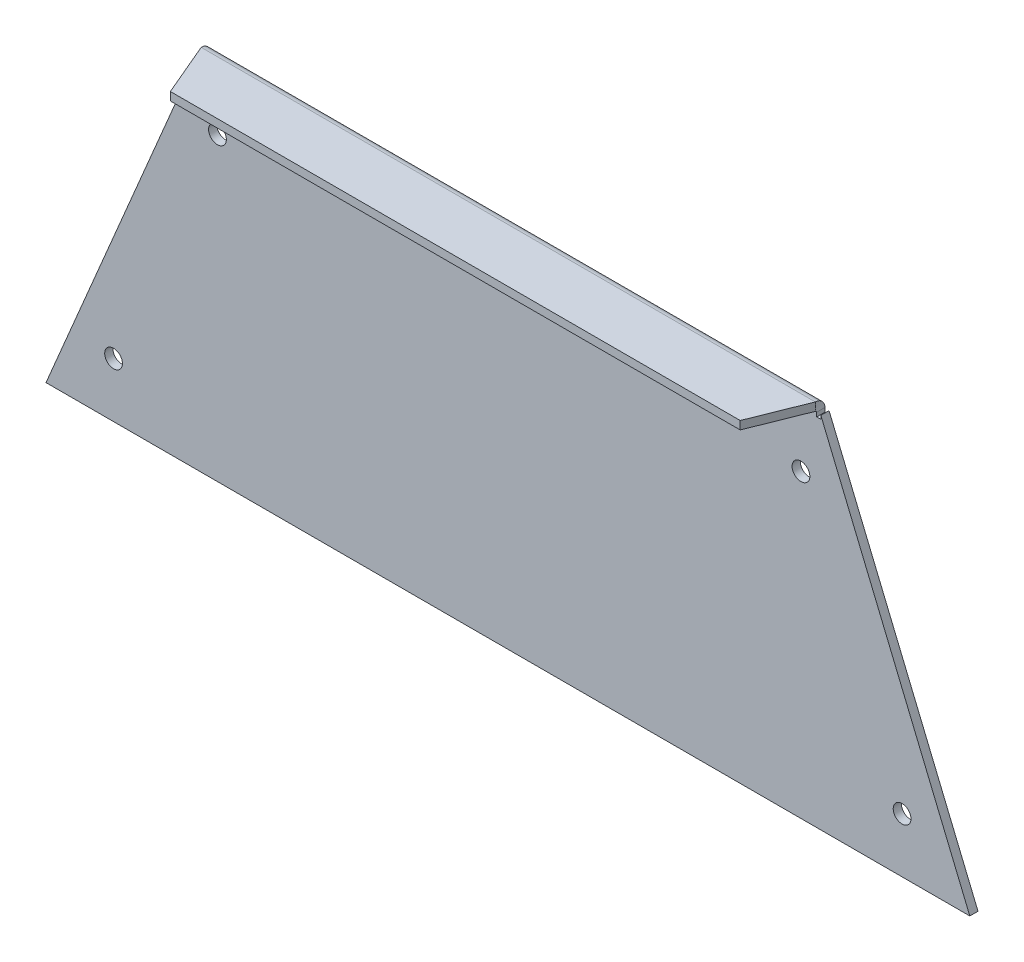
ISO-10303-21;
HEADER;
FILE_DESCRIPTION(('STEP AP214'),'2;1');
FILE_NAME('part.step','',(''),(''),'','','');
FILE_SCHEMA(('AUTOMOTIVE_DESIGN { 1 0 10303 214 1 1 1 1 }'));
ENDSEC;
DATA;
#1=APPLICATION_CONTEXT('core data for automotive mechanical design processes');
#2=APPLICATION_PROTOCOL_DEFINITION('international standard','automotive_design',2000,#1);
#3=PRODUCT_CONTEXT('',#1,'mechanical');
#4=PRODUCT('Part','Part','',(#3));
#5=PRODUCT_RELATED_PRODUCT_CATEGORY('part','',(#4));
#6=PRODUCT_DEFINITION_FORMATION('','',#4);
#7=PRODUCT_DEFINITION_CONTEXT('part definition',#1,'design');
#8=PRODUCT_DEFINITION('design','',#6,#7);
#9=PRODUCT_DEFINITION_SHAPE('','',#8);
#10=(LENGTH_UNIT() NAMED_UNIT(*) SI_UNIT(.MILLI.,.METRE.));
#11=(NAMED_UNIT(*) PLANE_ANGLE_UNIT() SI_UNIT($,.RADIAN.));
#12=(NAMED_UNIT(*) SI_UNIT($,.STERADIAN.) SOLID_ANGLE_UNIT());
#13=UNCERTAINTY_MEASURE_WITH_UNIT(LENGTH_MEASURE(1.E-05),#10,'distance_accuracy_value','');
#14=(GEOMETRIC_REPRESENTATION_CONTEXT(3) GLOBAL_UNCERTAINTY_ASSIGNED_CONTEXT((#13)) GLOBAL_UNIT_ASSIGNED_CONTEXT((#10,
#11,#12)) REPRESENTATION_CONTEXT('',''));
#15=CARTESIAN_POINT('',(0.,0.,0.));
#16=DIRECTION('',(0.,0.,1.));
#17=DIRECTION('',(1.,0.,0.));
#18=AXIS2_PLACEMENT_3D('',#15,#16,#17);
#19=CARTESIAN_POINT('',(-228.,-7.10526315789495,6.));
#20=DIRECTION('',(1.,0.,0.));
#21=DIRECTION('',(0.,1.,0.));
#22=AXIS2_PLACEMENT_3D('',#19,#20,#21);
#23=PLANE('',#22);
#24=DIRECTION('',(0.,-1.,0.));
#25=VECTOR('',#24,1.);
#26=CARTESIAN_POINT('',(-228.,0.,0.));
#27=LINE('',#26,#25);
#28=CARTESIAN_POINT('',(-228.,-7.10526315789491,0.));
#29=VERTEX_POINT('',#28);
#30=CARTESIAN_POINT('',(-228.,-9.73659999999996,0.));
#31=VERTEX_POINT('',#30);
#32=EDGE_CURVE('E15',#29,#31,#27,.T.);
#33=ORIENTED_EDGE('',*,*,#32,.F.);
#34=DIRECTION('',(0.,0.,-1.));
#35=VECTOR('',#34,1.);
#36=CARTESIAN_POINT('',(-228.,-7.10526315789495,6.));
#37=LINE('',#36,#35);
#38=CARTESIAN_POINT('',(-228.,-7.10526315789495,6.));
#39=VERTEX_POINT('',#38);
#40=EDGE_CURVE('E268',#39,#29,#37,.T.);
#41=ORIENTED_EDGE('',*,*,#40,.F.);
#42=DIRECTION('',(0.,-1.,0.));
#43=VECTOR('',#42,1.);
#44=CARTESIAN_POINT('',(-228.,-7.10526315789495,6.));
#45=LINE('',#44,#43);
#46=CARTESIAN_POINT('',(-228.,-9.7366,6.));
#47=VERTEX_POINT('',#46);
#48=EDGE_CURVE('E264',#39,#47,#45,.T.);
#49=ORIENTED_EDGE('',*,*,#48,.T.);
#50=DIRECTION('',(0.,0.,-1.));
#51=VECTOR('',#50,1.);
#52=CARTESIAN_POINT('',(-228.,-9.7366,6.));
#53=LINE('',#52,#51);
#54=EDGE_CURVE('E272',#47,#31,#53,.T.);
#55=ORIENTED_EDGE('',*,*,#54,.T.);
#56=EDGE_LOOP('',(#33,#41,#49,#55));
#57=FACE_BOUND('',#56,.T.);
#58=ADVANCED_FACE('F64',(#57),#23,.T.);
#59=CARTESIAN_POINT('',(-228.,-9.7366,6.));
#60=DIRECTION('',(0.,1.,0.));
#61=DIRECTION('',(0.,0.,1.));
#62=AXIS2_PLACEMENT_3D('',#59,#60,#61);
#63=PLANE('',#62);
#64=DIRECTION('',(1.,0.,0.));
#65=VECTOR('',#64,1.);
#66=CARTESIAN_POINT('',(-225.,-9.73659999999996,0.));
#67=LINE('',#66,#65);
#68=CARTESIAN_POINT('',(-225.,-9.73659999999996,0.));
#69=VERTEX_POINT('',#68);
#70=EDGE_CURVE('E73',#31,#69,#67,.T.);
#71=ORIENTED_EDGE('',*,*,#70,.F.);
#72=ORIENTED_EDGE('',*,*,#54,.F.);
#73=DIRECTION('',(1.,0.,0.));
#74=VECTOR('',#73,1.);
#75=CARTESIAN_POINT('',(-228.,-9.7366,6.));
#76=LINE('',#75,#74);
#77=CARTESIAN_POINT('',(-225.,-9.7366,6.));
#78=VERTEX_POINT('',#77);
#79=EDGE_CURVE('E269',#47,#78,#76,.T.);
#80=ORIENTED_EDGE('',*,*,#79,.T.);
#81=DIRECTION('',(0.,0.,-1.));
#82=VECTOR('',#81,1.);
#83=CARTESIAN_POINT('',(-225.,-9.7366,6.));
#84=LINE('',#83,#82);
#85=EDGE_CURVE('E276',#78,#69,#84,.T.);
#86=ORIENTED_EDGE('',*,*,#85,.T.);
#87=EDGE_LOOP('',(#71,#72,#80,#86));
#88=FACE_BOUND('',#87,.T.);
#89=ADVANCED_FACE('F390',(#88),#63,.T.);
#90=CARTESIAN_POINT('',(-225.,-9.7366,6.));
#91=DIRECTION('',(-1.,0.,0.));
#92=DIRECTION('',(0.,0.,1.));
#93=AXIS2_PLACEMENT_3D('',#90,#91,#92);
#94=PLANE('',#93);
#95=DIRECTION('',(0.,1.,0.));
#96=VECTOR('',#95,1.);
#97=CARTESIAN_POINT('',(-225.,0.,0.));
#98=LINE('',#97,#96);
#99=CARTESIAN_POINT('',(-225.,-6.7366,0.));
#100=VERTEX_POINT('',#99);
#101=EDGE_CURVE('E322',#69,#100,#98,.T.);
#102=ORIENTED_EDGE('',*,*,#101,.F.);
#103=ORIENTED_EDGE('',*,*,#85,.F.);
#104=DIRECTION('',(0.,1.,0.));
#105=VECTOR('',#104,1.);
#106=CARTESIAN_POINT('',(-225.,-9.7366,6.));
#107=LINE('',#106,#105);
#108=CARTESIAN_POINT('',(-225.,-6.7366,6.));
#109=VERTEX_POINT('',#108);
#110=EDGE_CURVE('E273',#78,#109,#107,.T.);
#111=ORIENTED_EDGE('',*,*,#110,.T.);
#112=DIRECTION('',(0.,0.,-1.));
#113=VECTOR('',#112,1.);
#114=CARTESIAN_POINT('',(-225.,-6.7366,6.));
#115=LINE('',#114,#113);
#116=EDGE_CURVE('E261',#109,#100,#115,.T.);
#117=ORIENTED_EDGE('',*,*,#116,.T.);
#118=EDGE_LOOP('',(#102,#103,#111,#117));
#119=FACE_BOUND('',#118,.T.);
#120=ADVANCED_FACE('F386',(#119),#94,.T.);
#121=CARTESIAN_POINT('',(225.,-6.7366,6.));
#122=DIRECTION('',(1.,0.,0.));
#123=DIRECTION('',(0.,0.,-1.));
#124=AXIS2_PLACEMENT_3D('',#121,#122,#123);
#125=PLANE('',#124);
#126=DIRECTION('',(0.,-1.,0.));
#127=VECTOR('',#126,1.);
#128=CARTESIAN_POINT('',(225.,0.,0.));
#129=LINE('',#128,#127);
#130=CARTESIAN_POINT('',(225.,-6.73659999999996,0.));
#131=VERTEX_POINT('',#130);
#132=CARTESIAN_POINT('',(225.,-9.73659999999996,0.));
#133=VERTEX_POINT('',#132);
#134=EDGE_CURVE('E319',#131,#133,#129,.T.);
#135=ORIENTED_EDGE('',*,*,#134,.F.);
#136=DIRECTION('',(0.,0.,-1.));
#137=VECTOR('',#136,1.);
#138=CARTESIAN_POINT('',(225.,-6.7366,6.));
#139=LINE('',#138,#137);
#140=CARTESIAN_POINT('',(225.,-6.7366,6.));
#141=VERTEX_POINT('',#140);
#142=EDGE_CURVE('E252',#141,#131,#139,.T.);
#143=ORIENTED_EDGE('',*,*,#142,.F.);
#144=DIRECTION('',(0.,-1.,0.));
#145=VECTOR('',#144,1.);
#146=CARTESIAN_POINT('',(225.,-6.7366,6.));
#147=LINE('',#146,#145);
#148=CARTESIAN_POINT('',(225.,-9.7366,6.));
#149=VERTEX_POINT('',#148);
#150=EDGE_CURVE('E277',#141,#149,#147,.T.);
#151=ORIENTED_EDGE('',*,*,#150,.T.);
#152=DIRECTION('',(0.,0.,-1.));
#153=VECTOR('',#152,1.);
#154=CARTESIAN_POINT('',(225.,-9.7366,6.));
#155=LINE('',#154,#153);
#156=EDGE_CURVE('E283',#149,#133,#155,.T.);
#157=ORIENTED_EDGE('',*,*,#156,.T.);
#158=EDGE_LOOP('',(#135,#143,#151,#157));
#159=FACE_BOUND('',#158,.T.);
#160=ADVANCED_FACE('F377',(#159),#125,.T.);
#161=CARTESIAN_POINT('',(225.,-9.7366,6.));
#162=DIRECTION('',(0.,1.,0.));
#163=DIRECTION('',(0.,0.,1.));
#164=AXIS2_PLACEMENT_3D('',#161,#162,#163);
#165=PLANE('',#164);
#166=DIRECTION('',(1.,0.,0.));
#167=VECTOR('',#166,1.);
#168=CARTESIAN_POINT('',(-225.,-9.73659999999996,0.));
#169=LINE('',#168,#167);
#170=CARTESIAN_POINT('',(228.,-9.73659999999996,0.));
#171=VERTEX_POINT('',#170);
#172=EDGE_CURVE('E316',#133,#171,#169,.T.);
#173=ORIENTED_EDGE('',*,*,#172,.F.);
#174=ORIENTED_EDGE('',*,*,#156,.F.);
#175=DIRECTION('',(1.,0.,0.));
#176=VECTOR('',#175,1.);
#177=CARTESIAN_POINT('',(225.,-9.7366,6.));
#178=LINE('',#177,#176);
#179=CARTESIAN_POINT('',(228.,-9.7366,6.));
#180=VERTEX_POINT('',#179);
#181=EDGE_CURVE('E280',#149,#180,#178,.T.);
#182=ORIENTED_EDGE('',*,*,#181,.T.);
#183=DIRECTION('',(0.,0.,-1.));
#184=VECTOR('',#183,1.);
#185=CARTESIAN_POINT('',(228.,-9.7366,6.));
#186=LINE('',#185,#184);
#187=EDGE_CURVE('E260',#180,#171,#186,.T.);
#188=ORIENTED_EDGE('',*,*,#187,.T.);
#189=EDGE_LOOP('',(#173,#174,#182,#188));
#190=FACE_BOUND('',#189,.T.);
#191=ADVANCED_FACE('F369',(#190),#165,.T.);
#192=CARTESIAN_POINT('',(228.,-9.7366,6.));
#193=DIRECTION('',(-1.,0.,0.));
#194=DIRECTION('',(0.,0.,1.));
#195=AXIS2_PLACEMENT_3D('',#192,#193,#194);
#196=PLANE('',#195);
#197=DIRECTION('',(0.,1.,0.));
#198=VECTOR('',#197,1.);
#199=CARTESIAN_POINT('',(228.,0.,0.));
#200=LINE('',#199,#198);
#201=CARTESIAN_POINT('',(228.,-7.23214285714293,0.));
#202=VERTEX_POINT('',#201);
#203=EDGE_CURVE('E314',#171,#202,#200,.T.);
#204=ORIENTED_EDGE('',*,*,#203,.F.);
#205=ORIENTED_EDGE('',*,*,#187,.F.);
#206=DIRECTION('',(0.,1.,0.));
#207=VECTOR('',#206,1.);
#208=CARTESIAN_POINT('',(228.,-9.7366,6.));
#209=LINE('',#208,#207);
#210=CARTESIAN_POINT('',(228.,-7.23214285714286,6.));
#211=VERTEX_POINT('',#210);
#212=EDGE_CURVE('E284',#180,#211,#209,.T.);
#213=ORIENTED_EDGE('',*,*,#212,.T.);
#214=DIRECTION('',(0.,0.,-1.));
#215=VECTOR('',#214,1.);
#216=CARTESIAN_POINT('',(228.,-7.23214285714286,6.));
#217=LINE('',#216,#215);
#218=EDGE_CURVE('E81',#211,#202,#217,.T.);
#219=ORIENTED_EDGE('',*,*,#218,.T.);
#220=EDGE_LOOP('',(#204,#205,#213,#219));
#221=FACE_BOUND('',#220,.T.);
#222=ADVANCED_FACE('F367',(#221),#196,.T.);
#223=CARTESIAN_POINT('',(-339.,-270.,6.));
#224=DIRECTION('',(0.921249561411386,-0.388972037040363,0.));
#225=DIRECTION('',(0.388972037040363,0.921249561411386,0.));
#226=AXIS2_PLACEMENT_3D('',#223,#224,#225);
#227=PLANE('',#226);
#228=ORIENTED_EDGE('',*,*,#40,.T.);
#229=DIRECTION('',(-0.388972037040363,-0.921249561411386,0.));
#230=VECTOR('',#229,1.);
#231=CARTESIAN_POINT('',(-339.,-270.,0.));
#232=LINE('',#231,#230);
#233=CARTESIAN_POINT('',(-339.,-270.,0.));
#234=VERTEX_POINT('',#233);
#235=EDGE_CURVE('E267',#29,#234,#232,.T.);
#236=ORIENTED_EDGE('',*,*,#235,.T.);
#237=DIRECTION('',(0.,0.,-1.));
#238=VECTOR('',#237,1.);
#239=CARTESIAN_POINT('',(-339.,-270.,6.));
#240=LINE('',#239,#238);
#241=CARTESIAN_POINT('',(-339.,-270.,6.));
#242=VERTEX_POINT('',#241);
#243=EDGE_CURVE('E311',#242,#234,#240,.T.);
#244=ORIENTED_EDGE('',*,*,#243,.F.);
#245=DIRECTION('',(-0.388972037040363,-0.921249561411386,0.));
#246=VECTOR('',#245,1.);
#247=CARTESIAN_POINT('',(-339.,-270.,6.));
#248=LINE('',#247,#246);
#249=EDGE_CURVE('E303',#39,#242,#248,.T.);
#250=ORIENTED_EDGE('',*,*,#249,.F.);
#251=EDGE_LOOP('',(#228,#236,#244,#250));
#252=FACE_BOUND('',#251,.T.);
#253=ADVANCED_FACE('F66',(#252),#227,.F.);
#254=CARTESIAN_POINT('',(225.,0.,6.));
#255=DIRECTION('',(-0.923683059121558,-0.383157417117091,0.));
#256=DIRECTION('',(0.383157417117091,-0.923683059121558,0.));
#257=AXIS2_PLACEMENT_3D('',#254,#255,#256);
#258=PLANE('',#257);
#259=ORIENTED_EDGE('',*,*,#218,.F.);
#260=DIRECTION('',(-0.383157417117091,0.923683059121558,0.));
#261=VECTOR('',#260,1.);
#262=CARTESIAN_POINT('',(225.,0.,6.));
#263=LINE('',#262,#261);
#264=CARTESIAN_POINT('',(337.,-270.,6.));
#265=VERTEX_POINT('',#264);
#266=EDGE_CURVE('E306',#265,#211,#263,.T.);
#267=ORIENTED_EDGE('',*,*,#266,.F.);
#268=DIRECTION('',(0.,0.,-1.));
#269=VECTOR('',#268,1.);
#270=CARTESIAN_POINT('',(337.,-270.,6.));
#271=LINE('',#270,#269);
#272=CARTESIAN_POINT('',(337.,-270.,0.));
#273=VERTEX_POINT('',#272);
#274=EDGE_CURVE('E308',#265,#273,#271,.T.);
#275=ORIENTED_EDGE('',*,*,#274,.T.);
#276=DIRECTION('',(-0.383157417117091,0.923683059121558,0.));
#277=VECTOR('',#276,1.);
#278=CARTESIAN_POINT('',(225.,0.,0.));
#279=LINE('',#278,#277);
#280=EDGE_CURVE('E300',#273,#202,#279,.T.);
#281=ORIENTED_EDGE('',*,*,#280,.T.);
#282=EDGE_LOOP('',(#259,#267,#275,#281));
#283=FACE_BOUND('',#282,.T.);
#284=ADVANCED_FACE('F375',(#283),#258,.F.);
#285=CARTESIAN_POINT('',(-225.,0.,6.));
#286=DIRECTION('',(0.,0.,-1.));
#287=DIRECTION('',(-1.,0.,0.));
#288=AXIS2_PLACEMENT_3D('',#285,#286,#287);
#289=PLANE('',#288);
#290=CARTESIAN_POINT('',(287.453354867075,-230.,6.));
#291=DIRECTION('',(0.,0.,1.));
#292=DIRECTION('',(1.,0.,0.));
#293=AXIS2_PLACEMENT_3D('',#290,#291,#292);
#294=CIRCLE('',#293,6.50000000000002);
#295=CARTESIAN_POINT('',(293.953354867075,-230.,6.));
#296=VERTEX_POINT('',#295);
#297=EDGE_CURVE('E345',#296,#296,#294,.T.);
#298=ORIENTED_EDGE('',*,*,#297,.F.);
#299=EDGE_LOOP('',(#298));
#300=FACE_BOUND('',#299,.T.);
#301=CARTESIAN_POINT('',(213.453354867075,-50.0000000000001,6.));
#302=DIRECTION('',(0.,0.,1.));
#303=DIRECTION('',(1.,0.,0.));
#304=AXIS2_PLACEMENT_3D('',#301,#302,#303);
#305=CIRCLE('',#304,6.50000000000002);
#306=CARTESIAN_POINT('',(219.953354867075,-50.0000000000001,6.));
#307=VERTEX_POINT('',#306);
#308=EDGE_CURVE('E335',#307,#307,#305,.T.);
#309=ORIENTED_EDGE('',*,*,#308,.F.);
#310=EDGE_LOOP('',(#309));
#311=FACE_BOUND('',#310,.T.);
#312=CARTESIAN_POINT('',(-289.546645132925,-230.,6.));
#313=DIRECTION('',(0.,0.,1.));
#314=DIRECTION('',(1.,0.,0.));
#315=AXIS2_PLACEMENT_3D('',#312,#313,#314);
#316=CIRCLE('',#315,6.50000000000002);
#317=CARTESIAN_POINT('',(-283.046645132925,-230.,6.));
#318=VERTEX_POINT('',#317);
#319=EDGE_CURVE('E332',#318,#318,#316,.T.);
#320=ORIENTED_EDGE('',*,*,#319,.F.);
#321=EDGE_LOOP('',(#320));
#322=FACE_BOUND('',#321,.T.);
#323=CARTESIAN_POINT('',(-213.546645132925,-50.0000000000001,6.));
#324=DIRECTION('',(0.,0.,1.));
#325=DIRECTION('',(1.,0.,0.));
#326=AXIS2_PLACEMENT_3D('',#323,#324,#325);
#327=CIRCLE('',#326,6.50000000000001);
#328=CARTESIAN_POINT('',(-207.046645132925,-50.0000000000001,6.));
#329=VERTEX_POINT('',#328);
#330=EDGE_CURVE('E329',#329,#329,#327,.T.);
#331=ORIENTED_EDGE('',*,*,#330,.F.);
#332=EDGE_LOOP('',(#331));
#333=FACE_BOUND('',#332,.T.);
#334=ORIENTED_EDGE('',*,*,#48,.F.);
#335=ORIENTED_EDGE('',*,*,#249,.T.);
#336=DIRECTION('',(1.,0.,0.));
#337=VECTOR('',#336,1.);
#338=CARTESIAN_POINT('',(337.,-270.,6.));
#339=LINE('',#338,#337);
#340=EDGE_CURVE('E89',#242,#265,#339,.T.);
#341=ORIENTED_EDGE('',*,*,#340,.T.);
#342=ORIENTED_EDGE('',*,*,#266,.T.);
#343=ORIENTED_EDGE('',*,*,#212,.F.);
#344=ORIENTED_EDGE('',*,*,#181,.F.);
#345=ORIENTED_EDGE('',*,*,#150,.F.);
#346=DIRECTION('',(-1.,0.,0.));
#347=VECTOR('',#346,1.);
#348=CARTESIAN_POINT('',(-225.,-6.7366,6.));
#349=LINE('',#348,#347);
#350=EDGE_CURVE('E210',#109,#141,#349,.F.);
#351=ORIENTED_EDGE('',*,*,#350,.F.);
#352=ORIENTED_EDGE('',*,*,#110,.F.);
#353=ORIENTED_EDGE('',*,*,#79,.F.);
#354=EDGE_LOOP('',(#334,#335,#341,#342,#343,#344,#345,#351,#352,#353));
#355=FACE_BOUND('',#354,.T.);
#356=ADVANCED_FACE('F402',(#300,#311,#322,#333,#355),#289,.F.);
#357=CARTESIAN_POINT('',(-225.,0.,0.));
#358=DIRECTION('',(0.,0.,-1.));
#359=DIRECTION('',(-1.,0.,0.));
#360=AXIS2_PLACEMENT_3D('',#357,#358,#359);
#361=PLANE('',#360);
#362=CARTESIAN_POINT('',(287.453354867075,-230.,0.));
#363=DIRECTION('',(0.,0.,-1.));
#364=DIRECTION('',(-1.,0.,0.));
#365=AXIS2_PLACEMENT_3D('',#362,#363,#364);
#366=CIRCLE('',#365,6.50000000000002);
#367=CARTESIAN_POINT('',(280.953354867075,-230.,0.));
#368=VERTEX_POINT('',#367);
#369=EDGE_CURVE('E68',#368,#368,#366,.T.);
#370=ORIENTED_EDGE('',*,*,#369,.F.);
#371=EDGE_LOOP('',(#370));
#372=FACE_BOUND('',#371,.T.);
#373=CARTESIAN_POINT('',(213.453354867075,-50.0000000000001,0.));
#374=DIRECTION('',(0.,0.,-1.));
#375=DIRECTION('',(-1.,0.,0.));
#376=AXIS2_PLACEMENT_3D('',#373,#374,#375);
#377=CIRCLE('',#376,6.50000000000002);
#378=CARTESIAN_POINT('',(206.953354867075,-50.0000000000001,0.));
#379=VERTEX_POINT('',#378);
#380=EDGE_CURVE('E333',#379,#379,#377,.T.);
#381=ORIENTED_EDGE('',*,*,#380,.F.);
#382=EDGE_LOOP('',(#381));
#383=FACE_BOUND('',#382,.T.);
#384=CARTESIAN_POINT('',(-289.546645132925,-230.,0.));
#385=DIRECTION('',(0.,0.,-1.));
#386=DIRECTION('',(-1.,0.,0.));
#387=AXIS2_PLACEMENT_3D('',#384,#385,#386);
#388=CIRCLE('',#387,6.50000000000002);
#389=CARTESIAN_POINT('',(-296.046645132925,-230.,0.));
#390=VERTEX_POINT('',#389);
#391=EDGE_CURVE('E330',#390,#390,#388,.T.);
#392=ORIENTED_EDGE('',*,*,#391,.F.);
#393=EDGE_LOOP('',(#392));
#394=FACE_BOUND('',#393,.T.);
#395=CARTESIAN_POINT('',(-213.546645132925,-50.0000000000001,0.));
#396=DIRECTION('',(0.,0.,-1.));
#397=DIRECTION('',(-1.,0.,0.));
#398=AXIS2_PLACEMENT_3D('',#395,#396,#397);
#399=CIRCLE('',#398,6.50000000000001);
#400=CARTESIAN_POINT('',(-220.046645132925,-50.0000000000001,0.));
#401=VERTEX_POINT('',#400);
#402=EDGE_CURVE('E209',#401,#401,#399,.T.);
#403=ORIENTED_EDGE('',*,*,#402,.F.);
#404=EDGE_LOOP('',(#403));
#405=FACE_BOUND('',#404,.T.);
#406=ORIENTED_EDGE('',*,*,#235,.F.);
#407=ORIENTED_EDGE('',*,*,#32,.T.);
#408=ORIENTED_EDGE('',*,*,#70,.T.);
#409=ORIENTED_EDGE('',*,*,#101,.T.);
#410=DIRECTION('',(-1.,0.,0.));
#411=VECTOR('',#410,1.);
#412=CARTESIAN_POINT('',(-225.,-6.7366,0.));
#413=LINE('',#412,#411);
#414=EDGE_CURVE('E219',#100,#131,#413,.F.);
#415=ORIENTED_EDGE('',*,*,#414,.T.);
#416=ORIENTED_EDGE('',*,*,#134,.T.);
#417=ORIENTED_EDGE('',*,*,#172,.T.);
#418=ORIENTED_EDGE('',*,*,#203,.T.);
#419=ORIENTED_EDGE('',*,*,#280,.F.);
#420=DIRECTION('',(1.,0.,0.));
#421=VECTOR('',#420,1.);
#422=CARTESIAN_POINT('',(337.,-270.,0.));
#423=LINE('',#422,#421);
#424=EDGE_CURVE('E298',#234,#273,#423,.T.);
#425=ORIENTED_EDGE('',*,*,#424,.F.);
#426=EDGE_LOOP('',(#406,#407,#408,#409,#415,#416,#417,#418,#419,#425));
#427=FACE_BOUND('',#426,.T.);
#428=ADVANCED_FACE('F398',(#372,#383,#394,#405,#427),#361,.T.);
#429=CARTESIAN_POINT('',(337.,-270.,6.));
#430=DIRECTION('',(0.,1.,0.));
#431=DIRECTION('',(-1.,0.,0.));
#432=AXIS2_PLACEMENT_3D('',#429,#430,#431);
#433=PLANE('',#432);
#434=ORIENTED_EDGE('',*,*,#424,.T.);
#435=ORIENTED_EDGE('',*,*,#274,.F.);
#436=ORIENTED_EDGE('',*,*,#340,.F.);
#437=ORIENTED_EDGE('',*,*,#243,.T.);
#438=EDGE_LOOP('',(#434,#435,#436,#437));
#439=FACE_BOUND('',#438,.T.);
#440=ADVANCED_FACE('F401',(#439),#433,.F.);
#441=CARTESIAN_POINT('',(225.,-6.7366,-0.0599999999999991));
#442=CARTESIAN_POINT('',(224.975442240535,-5.8467668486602,-0.0599999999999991));
#443=CARTESIAN_POINT('',(224.950893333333,-4.95760432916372,0.116897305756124));
#444=CARTESIAN_POINT('',(224.901786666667,-3.31370323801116,0.797823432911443));
#445=CARTESIAN_POINT('',(224.877233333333,-2.55977176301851,1.30158433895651));
#446=CARTESIAN_POINT('',(224.828126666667,-1.30158433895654,2.55977176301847));
#447=CARTESIAN_POINT('',(224.803573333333,-0.797823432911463,3.31370323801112));
#448=CARTESIAN_POINT('',(224.754466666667,-0.116897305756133,4.95760432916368));
#449=CARTESIAN_POINT('',(224.729917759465,0.0599999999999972,5.84676684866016));
#450=CARTESIAN_POINT('',(224.70536,0.0600000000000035,6.73659999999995));
#451=CARTESIAN_POINT('',(225.,-6.7366,0.));
#452=CARTESIAN_POINT('',(224.975442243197,-5.85462225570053,0.));
#453=CARTESIAN_POINT('',(224.950893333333,-4.97330920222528,0.175335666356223));
#454=CARTESIAN_POINT('',(224.901786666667,-3.34392037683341,0.850250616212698));
#455=CARTESIAN_POINT('',(224.877233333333,-2.596644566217,1.3495643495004));
#456=CARTESIAN_POINT('',(224.828126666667,-1.34956434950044,2.59664456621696));
#457=CARTESIAN_POINT('',(224.803573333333,-0.850250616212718,3.34392037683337));
#458=CARTESIAN_POINT('',(224.754466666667,-0.175335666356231,4.97330920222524));
#459=CARTESIAN_POINT('',(224.729917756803,0.,5.85462225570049));
#460=CARTESIAN_POINT('',(224.70536,0.,6.73659999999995));
#461=CARTESIAN_POINT('',(225.,-6.7366,6.));
#462=CARTESIAN_POINT('',(224.975442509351,-6.64016295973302,6.));
#463=CARTESIAN_POINT('',(224.950893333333,-6.54379650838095,6.01917172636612));
#464=CARTESIAN_POINT('',(224.901786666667,-6.36563425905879,6.09296894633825));
#465=CARTESIAN_POINT('',(224.877233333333,-6.28392488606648,6.1475654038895));
#466=CARTESIAN_POINT('',(224.828126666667,-6.1475654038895,6.28392488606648));
#467=CARTESIAN_POINT('',(224.803573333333,-6.09296894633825,6.36563425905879));
#468=CARTESIAN_POINT('',(224.754466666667,-6.01917172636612,6.54379650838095));
#469=CARTESIAN_POINT('',(224.729917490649,-6.,6.64016295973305));
#470=CARTESIAN_POINT('',(224.70536,-6.,6.7366));
#471=CARTESIAN_POINT('',(225.,-6.7366,6.0606));
#472=CARTESIAN_POINT('',(224.975442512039,-6.64809692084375,6.0606));
#473=CARTESIAN_POINT('',(224.950893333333,-6.55965843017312,6.07819447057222));
#474=CARTESIAN_POINT('',(224.901786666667,-6.39615356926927,6.14592040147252));
#475=CARTESIAN_POINT('',(224.877233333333,-6.32116641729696,6.19602521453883));
#476=CARTESIAN_POINT('',(224.828126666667,-6.19602521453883,6.32116641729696));
#477=CARTESIAN_POINT('',(224.803573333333,-6.14592040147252,6.39615356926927));
#478=CARTESIAN_POINT('',(224.754466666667,-6.07819447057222,6.55965843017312));
#479=CARTESIAN_POINT('',(224.729917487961,-6.0606,6.64809692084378));
#480=CARTESIAN_POINT('',(224.70536,-6.0606,6.7366));
#481=B_SPLINE_SURFACE_WITH_KNOTS('',1,3,((#441,#442,#443,#444,#445,#446,#447,#448,#449,#450),
(#451,#452,#453,#454,#455,#456,#457,#458,#459,#460),(#461,#462,#463,#464,#465,#466,#467,#468,
#469,#470),(#471,#472,#473,#474,#475,#476,#477,#478,#479,#480)),.UNSPECIFIED.,.F.,.F.,.F.,(2,1,
1,2),(4,2,2,2,4),(-0.01,0.,1.,1.0101),(0.,0.25,0.5,0.75,1.),.UNSPECIFIED.);
#482=DIRECTION('',(0.,-1.,0.));
#483=VECTOR('',#482,1.);
#484=CARTESIAN_POINT('',(224.70536,0.,6.73659999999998));
#485=LINE('',#484,#483);
#486=CARTESIAN_POINT('',(224.70536,-6.,6.7366));
#487=VERTEX_POINT('',#486);
#488=CARTESIAN_POINT('',(224.70536,0.,6.73659999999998));
#489=VERTEX_POINT('',#488);
#490=EDGE_CURVE('E192',#487,#489,#485,.F.);
#491=CARTESIAN_POINT('',(225.,-6.7366,6.));
#492=CARTESIAN_POINT('',(224.996930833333,-6.72454739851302,5.99999974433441));
#493=CARTESIAN_POINT('',(224.993861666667,-6.71249481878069,6.00029580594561));
#494=CARTESIAN_POINT('',(224.987723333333,-6.68841868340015,6.00147872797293));
#495=CARTESIAN_POINT('',(224.984654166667,-6.67639512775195,6.00236558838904));
#496=CARTESIAN_POINT('',(224.978515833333,-6.65240602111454,6.00472827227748));
#497=CARTESIAN_POINT('',(224.975446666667,-6.64044047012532,6.00620409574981));
#498=CARTESIAN_POINT('',(224.969308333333,-6.61659619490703,6.00974106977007));
#499=CARTESIAN_POINT('',(224.966239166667,-6.60471747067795,6.011802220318));
#500=CARTESIAN_POINT('',(224.960100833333,-6.5810754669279,6.01650490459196));
#501=CARTESIAN_POINT('',(224.957031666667,-6.56931218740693,6.01914643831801));
#502=CARTESIAN_POINT('',(224.950893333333,-6.54592941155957,6.0250035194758));
#503=CARTESIAN_POINT('',(224.947824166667,-6.53430991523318,6.02821906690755));
#504=CARTESIAN_POINT('',(224.941685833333,-6.51124269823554,6.03521643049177));
#505=CARTESIAN_POINT('',(224.938616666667,-6.49979497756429,6.03899824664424));
#506=CARTESIAN_POINT('',(224.932478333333,-6.4770988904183,6.04711903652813));
#507=CARTESIAN_POINT('',(224.929409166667,-6.46585052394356,6.05145801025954));
#508=CARTESIAN_POINT('',(224.923270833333,-6.44358024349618,6.06068266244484));
#509=CARTESIAN_POINT('',(224.920201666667,-6.43255832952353,6.06556834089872));
#510=CARTESIAN_POINT('',(224.914063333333,-6.41076750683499,6.07587463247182));
#511=CARTESIAN_POINT('',(224.910994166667,-6.3999985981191,6.08129524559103));
#512=CARTESIAN_POINT('',(224.904855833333,-6.37873972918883,6.09265834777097));
#513=CARTESIAN_POINT('',(224.901786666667,-6.36824976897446,6.09860083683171));
#514=CARTESIAN_POINT('',(224.895648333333,-6.34757406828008,6.1109933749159));
#515=CARTESIAN_POINT('',(224.892579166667,-6.33738832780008,6.11744342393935));
#516=CARTESIAN_POINT('',(224.886440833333,-6.31734560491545,6.13083554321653));
#517=CARTESIAN_POINT('',(224.883371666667,-6.30748862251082,6.13777761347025));
#518=CARTESIAN_POINT('',(224.877233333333,-6.28812716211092,6.15213705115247));
#519=CARTESIAN_POINT('',(224.874164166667,-6.27862268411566,6.15955441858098));
#520=CARTESIAN_POINT('',(224.868025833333,-6.25998912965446,6.17484658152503));
#521=CARTESIAN_POINT('',(224.864956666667,-6.25086005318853,6.18272137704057));
#522=CARTESIAN_POINT('',(224.858818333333,-6.23299929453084,6.19890942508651));
#523=CARTESIAN_POINT('',(224.855749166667,-6.22426761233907,6.2072226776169));
#524=CARTESIAN_POINT('',(224.849610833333,-6.2072226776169,6.22426761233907));
#525=CARTESIAN_POINT('',(224.846541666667,-6.1989094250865,6.23299929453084));
#526=CARTESIAN_POINT('',(224.840403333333,-6.18272137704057,6.25086005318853));
#527=CARTESIAN_POINT('',(224.837334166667,-6.17484658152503,6.25998912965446));
#528=CARTESIAN_POINT('',(224.831195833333,-6.15955441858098,6.27862268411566));
#529=CARTESIAN_POINT('',(224.828126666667,-6.15213705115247,6.28812716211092));
#530=CARTESIAN_POINT('',(224.821988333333,-6.13777761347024,6.30748862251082));
#531=CARTESIAN_POINT('',(224.818919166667,-6.13083554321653,6.31734560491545));
#532=CARTESIAN_POINT('',(224.812780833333,-6.11744342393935,6.33738832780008));
#533=CARTESIAN_POINT('',(224.809711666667,-6.11099337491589,6.34757406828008));
#534=CARTESIAN_POINT('',(224.803573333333,-6.0986008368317,6.36824976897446));
#535=CARTESIAN_POINT('',(224.800504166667,-6.09265834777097,6.37873972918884));
#536=CARTESIAN_POINT('',(224.794365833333,-6.08129524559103,6.3999985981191));
#537=CARTESIAN_POINT('',(224.791296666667,-6.07587463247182,6.41076750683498));
#538=CARTESIAN_POINT('',(224.785158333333,-6.06556834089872,6.43255832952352));
#539=CARTESIAN_POINT('',(224.782089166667,-6.06068266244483,6.44358024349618));
#540=CARTESIAN_POINT('',(224.775950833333,-6.05145801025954,6.46585052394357));
#541=CARTESIAN_POINT('',(224.772881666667,-6.04711903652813,6.4770988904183));
#542=CARTESIAN_POINT('',(224.766743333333,-6.03899824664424,6.49979497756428));
#543=CARTESIAN_POINT('',(224.763674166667,-6.03521643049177,6.51124269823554));
#544=CARTESIAN_POINT('',(224.757535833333,-6.02821906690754,6.53430991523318));
#545=CARTESIAN_POINT('',(224.754466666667,-6.02500351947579,6.54592941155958));
#546=CARTESIAN_POINT('',(224.748328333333,-6.019146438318,6.56931218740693));
#547=CARTESIAN_POINT('',(224.745259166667,-6.01650490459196,6.58107546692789));
#548=CARTESIAN_POINT('',(224.739120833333,-6.011802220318,6.60471747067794));
#549=CARTESIAN_POINT('',(224.736051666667,-6.00974106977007,6.61659619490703));
#550=CARTESIAN_POINT('',(224.729913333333,-6.00620409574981,6.64044047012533));
#551=CARTESIAN_POINT('',(224.726844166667,-6.00472827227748,6.65240602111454));
#552=CARTESIAN_POINT('',(224.720705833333,-6.00236558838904,6.67639512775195));
#553=CARTESIAN_POINT('',(224.717636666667,-6.00147872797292,6.68841868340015));
#554=CARTESIAN_POINT('',(224.711498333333,-6.00029580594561,6.71249481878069));
#555=CARTESIAN_POINT('',(224.708429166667,-5.99999974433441,6.72454739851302));
#556=CARTESIAN_POINT('',(224.70536,-6.,6.7366));
#557=B_SPLINE_CURVE_WITH_KNOTS('',3,(#491,#492,#493,#494,#495,#496,#497,#498,#499,#500,#501,
#502,#503,#504,#505,#506,#507,#508,#509,#510,#511,#512,#513,#514,#515,#516,#517,#518,#519,#520,
#521,#522,#523,#524,#525,#526,#527,#528,#529,#530,#531,#532,#533,#534,#535,#536,#537,#538,#539,
#540,#541,#542,#543,#544,#545,#546,#547,#548,#549,#550,#551,#552,#553,#554,#555,#556),
.UNSPECIFIED.,.F.,.F.,(4,2,2,2,2,2,2,2,2,2,2,2,2,2,2,2,2,2,2,2,2,2,2,2,2,2,2,2,2,2,2,2,4),(0.,
0.0373081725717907,0.0746163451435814,0.111924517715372,0.149232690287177,0.186540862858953,
0.223849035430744,0.261157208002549,0.298465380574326,0.33577355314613,0.373081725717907,
0.410389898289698,0.447698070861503,0.48500624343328,0.522314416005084,0.559622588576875,
0.596930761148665,0.634238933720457,0.671547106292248,0.708855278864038,0.746163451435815,
0.78347162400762,0.82077979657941,0.858087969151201,0.895396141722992,0.932704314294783,
0.970012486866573,1.00732065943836,1.04462883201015,1.08193700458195,1.11924517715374,
1.15655334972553,1.19386152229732),.UNSPECIFIED.);
#558=EDGE_CURVE('E212',#141,#487,#557,.T.);
#559=CARTESIAN_POINT('',(225.,-6.7366,0.));
#560=CARTESIAN_POINT('',(224.996930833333,-6.62637252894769,-2.33819824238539E-06));
#561=CARTESIAN_POINT('',(224.993861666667,-6.51614525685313,0.00270530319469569));
#562=CARTESIAN_POINT('',(224.987723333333,-6.2959561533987,0.0135237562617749));
#563=CARTESIAN_POINT('',(224.984654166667,-6.18599432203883,0.0216345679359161));
#564=CARTESIAN_POINT('',(224.978515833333,-5.96660114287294,0.0432425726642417));
#565=CARTESIAN_POINT('',(224.975446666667,-5.85716979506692,0.0567397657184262));
#566=CARTESIAN_POINT('',(224.969308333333,-5.6391011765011,0.089087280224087));
#567=CARTESIAN_POINT('',(224.966239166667,-5.5304639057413,0.107937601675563));
#568=CARTESIAN_POINT('',(224.960100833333,-5.314245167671,0.150946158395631));
#569=CARTESIAN_POINT('',(224.957031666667,-5.20666370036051,0.175104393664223));
#570=CARTESIAN_POINT('',(224.950893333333,-4.99281573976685,0.228670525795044));
#571=CARTESIAN_POINT('',(224.947824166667,-4.8865492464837,0.258078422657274));
#572=CARTESIAN_POINT('',(224.941685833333,-4.67558723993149,0.322073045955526));
#573=CARTESIAN_POINT('',(224.938616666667,-4.57089172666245,0.356659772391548));
#574=CARTESIAN_POINT('',(224.932478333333,-4.36332390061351,0.43092872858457));
#575=CARTESIAN_POINT('',(224.929409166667,-4.26045158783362,0.47061095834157));
#576=CARTESIAN_POINT('',(224.923270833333,-4.05677799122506,0.554975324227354));
#577=CARTESIAN_POINT('',(224.920201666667,-3.95597670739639,0.599657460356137));
#578=CARTESIAN_POINT('',(224.914063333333,-3.75668800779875,0.693913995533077));
#579=CARTESIAN_POINT('',(224.910994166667,-3.65820059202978,0.743488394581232));
#580=CARTESIAN_POINT('',(224.904855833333,-3.46377689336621,0.847410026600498));
#581=CARTESIAN_POINT('',(224.901786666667,-3.3678406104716,0.901757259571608));
#582=CARTESIAN_POINT('',(224.895648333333,-3.17875029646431,1.01509363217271));
#583=CARTESIAN_POINT('',(224.892579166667,-3.08559626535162,1.07408277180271));
#584=CARTESIAN_POINT('',(224.886440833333,-2.9022948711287,1.19656084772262));
#585=CARTESIAN_POINT('',(224.883371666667,-2.81214750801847,1.26004978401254));
#586=CARTESIAN_POINT('',(224.877233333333,-2.6350766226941,1.39137450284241));
#587=CARTESIAN_POINT('',(224.874164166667,-2.54815310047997,1.45921028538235));
#588=CARTESIAN_POINT('',(224.868025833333,-2.37773930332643,1.59906527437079));
#589=CARTESIAN_POINT('',(224.864956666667,-2.29424902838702,1.67108448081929));
#590=CARTESIAN_POINT('',(224.858818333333,-2.13090286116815,1.81913281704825));
#591=CARTESIAN_POINT('',(224.855749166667,-2.05104696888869,1.89516194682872));
#592=CARTESIAN_POINT('',(224.849610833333,-1.89516194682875,2.05104696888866));
#593=CARTESIAN_POINT('',(224.846541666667,-1.81913281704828,2.13090286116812));
#594=CARTESIAN_POINT('',(224.840403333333,-1.67108448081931,2.29424902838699));
#595=CARTESIAN_POINT('',(224.837334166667,-1.59906527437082,2.3777393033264));
#596=CARTESIAN_POINT('',(224.831195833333,-1.45921028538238,2.54815310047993));
#597=CARTESIAN_POINT('',(224.828126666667,-1.39137450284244,2.63507662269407));
#598=CARTESIAN_POINT('',(224.821988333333,-1.26004978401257,2.81214750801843));
#599=CARTESIAN_POINT('',(224.818919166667,-1.19656084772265,2.90229487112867));
#600=CARTESIAN_POINT('',(224.812780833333,-1.07408277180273,3.08559626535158));
#601=CARTESIAN_POINT('',(224.809711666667,-1.01509363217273,3.17875029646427));
#602=CARTESIAN_POINT('',(224.803573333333,-0.901757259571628,3.36784061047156));
#603=CARTESIAN_POINT('',(224.800504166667,-0.847410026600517,3.46377689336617));
#604=CARTESIAN_POINT('',(224.794365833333,-0.74348839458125,3.65820059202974));
#605=CARTESIAN_POINT('',(224.791296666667,-0.693913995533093,3.75668800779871));
#606=CARTESIAN_POINT('',(224.785158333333,-0.599657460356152,3.95597670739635));
#607=CARTESIAN_POINT('',(224.782089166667,-0.554975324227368,4.05677799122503));
#608=CARTESIAN_POINT('',(224.775950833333,-0.470610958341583,4.26045158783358));
#609=CARTESIAN_POINT('',(224.772881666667,-0.430928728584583,4.36332390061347));
#610=CARTESIAN_POINT('',(224.766743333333,-0.35665977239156,4.5708917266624));
#611=CARTESIAN_POINT('',(224.763674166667,-0.322073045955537,4.67558723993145));
#612=CARTESIAN_POINT('',(224.757535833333,-0.258078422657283,4.88654924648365));
#613=CARTESIAN_POINT('',(224.754466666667,-0.228670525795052,4.99281573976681));
#614=CARTESIAN_POINT('',(224.748328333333,-0.17510439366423,5.20666370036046));
#615=CARTESIAN_POINT('',(224.745259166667,-0.150946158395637,5.31424516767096));
#616=CARTESIAN_POINT('',(224.739120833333,-0.107937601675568,5.53046390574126));
#617=CARTESIAN_POINT('',(224.736051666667,-0.0890872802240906,5.63910117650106));
#618=CARTESIAN_POINT('',(224.729913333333,-0.0567397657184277,5.85716979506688));
#619=CARTESIAN_POINT('',(224.726844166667,-0.0432425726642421,5.96660114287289));
#620=CARTESIAN_POINT('',(224.720705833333,-0.0216345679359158,6.18599432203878));
#621=CARTESIAN_POINT('',(224.717636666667,-0.0135237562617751,6.29595615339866));
#622=CARTESIAN_POINT('',(224.711498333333,-0.00270530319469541,6.51614525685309));
#623=CARTESIAN_POINT('',(224.708429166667,2.33819824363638E-06,6.62637252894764));
#624=CARTESIAN_POINT('',(224.70536,0.,6.73659999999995));
#625=B_SPLINE_CURVE_WITH_KNOTS('',3,(#559,#560,#561,#562,#563,#564,#565,#566,#567,#568,#569,
#570,#571,#572,#573,#574,#575,#576,#577,#578,#579,#580,#581,#582,#583,#584,#585,#586,#587,#588,
#589,#590,#591,#592,#593,#594,#595,#596,#597,#598,#599,#600,#601,#602,#603,#604,#605,#606,#607,
#608,#609,#610,#611,#612,#613,#614,#615,#616,#617,#618,#619,#620,#621,#622,#623,#624),
.UNSPECIFIED.,.F.,.F.,(4,2,2,2,2,2,2,2,2,2,2,2,2,2,2,2,2,2,2,2,2,2,2,2,2,2,2,2,2,2,2,2,4),(0.,
0.330777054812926,0.661554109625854,0.992331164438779,1.32310821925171,1.65388527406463,
1.98466232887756,2.31543938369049,2.64621643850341,2.97699349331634,3.30777054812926,
3.63854760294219,3.96932465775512,4.30010171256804,4.63087876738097,4.9616558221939,
5.29243287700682,5.62320993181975,5.95398698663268,6.2847640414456,6.61554109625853,
6.94631815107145,7.27709520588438,7.60787226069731,7.93864931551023,8.26942637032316,
8.60020342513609,8.93098047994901,9.26175753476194,9.59253458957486,9.92331164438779,
10.2540886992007,10.5848657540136),.UNSPECIFIED.);
#626=EDGE_CURVE('E242',#131,#489,#625,.T.);
#627=ORIENTED_EDGE('',*,*,#490,.F.);
#628=ORIENTED_EDGE('',*,*,#558,.F.);
#629=ORIENTED_EDGE('',*,*,#142,.T.);
#630=ORIENTED_EDGE('',*,*,#626,.T.);
#631=EDGE_LOOP('',(#627,#628,#629,#630));
#632=FACE_BOUND('',#631,.T.);
#633=ADVANCED_FACE('F410',(#632),#481,.F.);
#634=CARTESIAN_POINT('',(-224.686945,0.0600000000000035,6.73660000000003));
#635=CARTESIAN_POINT('',(-224.713037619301,0.0600000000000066,5.84676686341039));
#636=CARTESIAN_POINT('',(-224.739120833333,-0.116897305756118,4.95760432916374));
#637=CARTESIAN_POINT('',(-224.791296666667,-0.797823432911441,3.31370323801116));
#638=CARTESIAN_POINT('',(-224.817384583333,-1.30158433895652,2.55977176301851));
#639=CARTESIAN_POINT('',(-224.869560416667,-2.55977176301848,1.30158433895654));
#640=CARTESIAN_POINT('',(-224.895648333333,-3.31370323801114,0.797823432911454));
#641=CARTESIAN_POINT('',(-224.947824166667,-4.95760432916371,0.116897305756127));
#642=CARTESIAN_POINT('',(-224.973907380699,-5.84676686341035,-0.0599999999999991));
#643=CARTESIAN_POINT('',(-225.,-6.7366,-0.0599999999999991));
#644=CARTESIAN_POINT('',(-224.686945,0.,6.73660000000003));
#645=CARTESIAN_POINT('',(-224.713037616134,0.,5.85462227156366));
#646=CARTESIAN_POINT('',(-224.739120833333,-0.175335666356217,4.97330920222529));
#647=CARTESIAN_POINT('',(-224.791296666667,-0.850250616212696,3.34392037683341));
#648=CARTESIAN_POINT('',(-224.817384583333,-1.34956434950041,2.596644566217));
#649=CARTESIAN_POINT('',(-224.869560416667,-2.59664456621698,1.34956434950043));
#650=CARTESIAN_POINT('',(-224.895648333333,-3.34392037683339,0.85025061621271));
#651=CARTESIAN_POINT('',(-224.947824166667,-4.97330920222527,0.175335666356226));
#652=CARTESIAN_POINT('',(-224.973907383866,-5.85462227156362,0.));
#653=CARTESIAN_POINT('',(-225.,-6.7366,0.));
#654=CARTESIAN_POINT('',(-224.686945,-6.,6.7366));
#655=CARTESIAN_POINT('',(-224.71303729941,-6.,6.6401630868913));
#656=CARTESIAN_POINT('',(-224.739120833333,-6.01917172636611,6.54379650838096));
#657=CARTESIAN_POINT('',(-224.791296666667,-6.09296894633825,6.3656342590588));
#658=CARTESIAN_POINT('',(-224.817384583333,-6.1475654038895,6.28392488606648));
#659=CARTESIAN_POINT('',(-224.869560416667,-6.28392488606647,6.1475654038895));
#660=CARTESIAN_POINT('',(-224.895648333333,-6.36563425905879,6.09296894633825));
#661=CARTESIAN_POINT('',(-224.947824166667,-6.54379650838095,6.01917172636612));
#662=CARTESIAN_POINT('',(-224.97390770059,-6.6401630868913,6.));
#663=CARTESIAN_POINT('',(-225.,-6.7366,6.));
#664=B_SPLINE_SURFACE_WITH_KNOTS('',1,3,((#634,#635,#636,#637,#638,#639,#640,#641,#642,#643),
(#644,#645,#646,#647,#648,#649,#650,#651,#652,#653),(#654,#655,#656,#657,#658,#659,#660,#661,
#662,#663)),.UNSPECIFIED.,.F.,.F.,.F.,(2,1,2),(4,2,2,2,4),(-0.01,0.,1.),(0.,0.25,0.5,0.75,1.),.UNSPECIFIED.);
#665=CARTESIAN_POINT('',(-224.686945,-6.,6.7366));
#666=CARTESIAN_POINT('',(-224.690205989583,-5.9999997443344,6.72454739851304));
#667=CARTESIAN_POINT('',(-224.693466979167,-6.00029580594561,6.7124948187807));
#668=CARTESIAN_POINT('',(-224.699988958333,-6.00147872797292,6.68841868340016));
#669=CARTESIAN_POINT('',(-224.703249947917,-6.00236558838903,6.67639512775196));
#670=CARTESIAN_POINT('',(-224.709771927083,-6.00472827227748,6.65240602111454));
#671=CARTESIAN_POINT('',(-224.713032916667,-6.00620409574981,6.64044047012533));
#672=CARTESIAN_POINT('',(-224.719554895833,-6.00974106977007,6.61659619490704));
#673=CARTESIAN_POINT('',(-224.722815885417,-6.01180222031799,6.60471747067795));
#674=CARTESIAN_POINT('',(-224.729337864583,-6.01650490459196,6.5810754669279));
#675=CARTESIAN_POINT('',(-224.732598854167,-6.019146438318,6.56931218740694));
#676=CARTESIAN_POINT('',(-224.739120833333,-6.02500351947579,6.54592941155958));
#677=CARTESIAN_POINT('',(-224.742381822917,-6.02821906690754,6.53430991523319));
#678=CARTESIAN_POINT('',(-224.748903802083,-6.03521643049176,6.51124269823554));
#679=CARTESIAN_POINT('',(-224.752164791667,-6.03899824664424,6.49979497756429));
#680=CARTESIAN_POINT('',(-224.758686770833,-6.04711903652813,6.4770988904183));
#681=CARTESIAN_POINT('',(-224.761947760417,-6.05145801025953,6.46585052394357));
#682=CARTESIAN_POINT('',(-224.768469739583,-6.06068266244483,6.44358024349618));
#683=CARTESIAN_POINT('',(-224.771730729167,-6.06556834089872,6.43255832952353));
#684=CARTESIAN_POINT('',(-224.778252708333,-6.07587463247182,6.41076750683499));
#685=CARTESIAN_POINT('',(-224.781513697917,-6.08129524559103,6.3999985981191));
#686=CARTESIAN_POINT('',(-224.788035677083,-6.09265834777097,6.37873972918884));
#687=CARTESIAN_POINT('',(-224.791296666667,-6.0986008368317,6.36824976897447));
#688=CARTESIAN_POINT('',(-224.797818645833,-6.11099337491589,6.34757406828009));
#689=CARTESIAN_POINT('',(-224.801079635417,-6.11744342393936,6.33738832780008));
#690=CARTESIAN_POINT('',(-224.807601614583,-6.13083554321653,6.31734560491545));
#691=CARTESIAN_POINT('',(-224.810862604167,-6.13777761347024,6.30748862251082));
#692=CARTESIAN_POINT('',(-224.817384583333,-6.15213705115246,6.28812716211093));
#693=CARTESIAN_POINT('',(-224.820645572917,-6.15955441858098,6.27862268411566));
#694=CARTESIAN_POINT('',(-224.827167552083,-6.17484658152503,6.25998912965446));
#695=CARTESIAN_POINT('',(-224.830428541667,-6.18272137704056,6.25086005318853));
#696=CARTESIAN_POINT('',(-224.836950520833,-6.1989094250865,6.23299929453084));
#697=CARTESIAN_POINT('',(-224.840211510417,-6.2072226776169,6.22426761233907));
#698=CARTESIAN_POINT('',(-224.846733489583,-6.22426761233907,6.20722267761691));
#699=CARTESIAN_POINT('',(-224.849994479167,-6.23299929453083,6.19890942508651));
#700=CARTESIAN_POINT('',(-224.856516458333,-6.25086005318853,6.18272137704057));
#701=CARTESIAN_POINT('',(-224.859777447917,-6.25998912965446,6.17484658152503));
#702=CARTESIAN_POINT('',(-224.866299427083,-6.27862268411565,6.15955441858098));
#703=CARTESIAN_POINT('',(-224.869560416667,-6.28812716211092,6.15213705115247));
#704=CARTESIAN_POINT('',(-224.876082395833,-6.30748862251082,6.13777761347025));
#705=CARTESIAN_POINT('',(-224.879343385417,-6.31734560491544,6.13083554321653));
#706=CARTESIAN_POINT('',(-224.885865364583,-6.33738832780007,6.11744342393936));
#707=CARTESIAN_POINT('',(-224.889126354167,-6.34757406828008,6.1109933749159));
#708=CARTESIAN_POINT('',(-224.895648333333,-6.36824976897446,6.0986008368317));
#709=CARTESIAN_POINT('',(-224.898909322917,-6.37873972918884,6.09265834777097));
#710=CARTESIAN_POINT('',(-224.905431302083,-6.39999859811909,6.08129524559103));
#711=CARTESIAN_POINT('',(-224.908692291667,-6.41076750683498,6.07587463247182));
#712=CARTESIAN_POINT('',(-224.915214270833,-6.43255832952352,6.06556834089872));
#713=CARTESIAN_POINT('',(-224.918475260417,-6.44358024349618,6.06068266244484));
#714=CARTESIAN_POINT('',(-224.924997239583,-6.46585052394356,6.05145801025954));
#715=CARTESIAN_POINT('',(-224.928258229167,-6.47709889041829,6.04711903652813));
#716=CARTESIAN_POINT('',(-224.934780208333,-6.49979497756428,6.03899824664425));
#717=CARTESIAN_POINT('',(-224.938041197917,-6.51124269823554,6.03521643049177));
#718=CARTESIAN_POINT('',(-224.944563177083,-6.53430991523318,6.02821906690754));
#719=CARTESIAN_POINT('',(-224.947824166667,-6.54592941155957,6.02500351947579));
#720=CARTESIAN_POINT('',(-224.954346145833,-6.56931218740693,6.01914643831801));
#721=CARTESIAN_POINT('',(-224.957607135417,-6.58107546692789,6.01650490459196));
#722=CARTESIAN_POINT('',(-224.964129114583,-6.60471747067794,6.011802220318));
#723=CARTESIAN_POINT('',(-224.967390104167,-6.61659619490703,6.00974106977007));
#724=CARTESIAN_POINT('',(-224.973912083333,-6.64044047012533,6.00620409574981));
#725=CARTESIAN_POINT('',(-224.977173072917,-6.65240602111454,6.00472827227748));
#726=CARTESIAN_POINT('',(-224.983695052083,-6.67639512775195,6.00236558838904));
#727=CARTESIAN_POINT('',(-224.986956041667,-6.68841868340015,6.00147872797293));
#728=CARTESIAN_POINT('',(-224.993478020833,-6.71249481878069,6.00029580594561));
#729=CARTESIAN_POINT('',(-224.996739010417,-6.72454739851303,5.99999974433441));
#730=CARTESIAN_POINT('',(-225.,-6.7366,6.));
#731=B_SPLINE_CURVE_WITH_KNOTS('',3,(#665,#666,#667,#668,#669,#670,#671,#672,#673,#674,#675,
#676,#677,#678,#679,#680,#681,#682,#683,#684,#685,#686,#687,#688,#689,#690,#691,#692,#693,#694,
#695,#696,#697,#698,#699,#700,#701,#702,#703,#704,#705,#706,#707,#708,#709,#710,#711,#712,#713,
#714,#715,#716,#717,#718,#719,#720,#721,#722,#723,#724,#725,#726,#727,#728,#729,#730),
.UNSPECIFIED.,.F.,.F.,(4,2,2,2,2,2,2,2,2,2,2,2,2,2,2,2,2,2,2,2,2,2,2,2,2,2,2,2,2,2,2,2,4),(0.,
0.0374543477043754,0.0749086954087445,0.11236304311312,0.149817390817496,0.187271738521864,
0.22472608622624,0.262180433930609,0.299634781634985,0.33708912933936,0.374543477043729,
0.411997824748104,0.449452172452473,0.486906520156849,0.524360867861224,0.561815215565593,
0.599269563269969,0.636723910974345,0.674178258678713,0.711632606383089,0.749086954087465,
0.786541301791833,0.823995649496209,0.861449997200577,0.898904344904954,0.936358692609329,
0.973813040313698,1.01126738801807,1.04872173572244,1.08617608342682,1.12363043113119,
1.16108477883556,1.19853912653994),.UNSPECIFIED.);
#732=CARTESIAN_POINT('',(-224.686945,-6.,6.7366));
#733=VERTEX_POINT('',#732);
#734=EDGE_CURVE('E213',#733,#109,#731,.T.);
#735=DIRECTION('',(0.,-1.,0.));
#736=VECTOR('',#735,1.);
#737=CARTESIAN_POINT('',(-224.686945,-6.,6.7366));
#738=LINE('',#737,#736);
#739=CARTESIAN_POINT('',(-224.686945,0.,6.73659999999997));
#740=VERTEX_POINT('',#739);
#741=EDGE_CURVE('E203',#733,#740,#738,.F.);
#742=CARTESIAN_POINT('',(-224.686945,0.,6.73660000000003));
#743=CARTESIAN_POINT('',(-224.690205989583,2.33819824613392E-06,6.62637252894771));
#744=CARTESIAN_POINT('',(-224.693466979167,-0.00270530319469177,6.51614525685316));
#745=CARTESIAN_POINT('',(-224.699988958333,-0.0135237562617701,6.29595615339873));
#746=CARTESIAN_POINT('',(-224.703249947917,-0.0216345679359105,6.18599432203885));
#747=CARTESIAN_POINT('',(-224.709771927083,-0.0432425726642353,5.96660114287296));
#748=CARTESIAN_POINT('',(-224.713032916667,-0.0567397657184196,5.85716979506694));
#749=CARTESIAN_POINT('',(-224.719554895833,-0.0890872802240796,5.63910117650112));
#750=CARTESIAN_POINT('',(-224.722815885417,-0.107937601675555,5.53046390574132));
#751=CARTESIAN_POINT('',(-224.729337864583,-0.150946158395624,5.31424516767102));
#752=CARTESIAN_POINT('',(-224.732598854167,-0.175104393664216,5.20666370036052));
#753=CARTESIAN_POINT('',(-224.739120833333,-0.228670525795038,4.99281573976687));
#754=CARTESIAN_POINT('',(-224.742381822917,-0.258078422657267,4.88654924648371));
#755=CARTESIAN_POINT('',(-224.748903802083,-0.322073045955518,4.67558723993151));
#756=CARTESIAN_POINT('',(-224.752164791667,-0.356659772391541,4.57089172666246));
#757=CARTESIAN_POINT('',(-224.758686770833,-0.430928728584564,4.36332390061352));
#758=CARTESIAN_POINT('',(-224.761947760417,-0.470610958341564,4.26045158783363));
#759=CARTESIAN_POINT('',(-224.768469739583,-0.554975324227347,4.05677799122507));
#760=CARTESIAN_POINT('',(-224.771730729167,-0.599657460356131,3.9559767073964));
#761=CARTESIAN_POINT('',(-224.778252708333,-0.693913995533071,3.75668800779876));
#762=CARTESIAN_POINT('',(-224.781513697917,-0.743488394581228,3.65820059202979));
#763=CARTESIAN_POINT('',(-224.788035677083,-0.847410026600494,3.46377689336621));
#764=CARTESIAN_POINT('',(-224.791296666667,-0.901757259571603,3.3678406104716));
#765=CARTESIAN_POINT('',(-224.797818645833,-1.01509363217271,3.17875029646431));
#766=CARTESIAN_POINT('',(-224.801079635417,-1.0740827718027,3.08559626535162));
#767=CARTESIAN_POINT('',(-224.807601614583,-1.19656084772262,2.9022948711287));
#768=CARTESIAN_POINT('',(-224.810862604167,-1.26004978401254,2.81214750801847));
#769=CARTESIAN_POINT('',(-224.817384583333,-1.39137450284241,2.6350766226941));
#770=CARTESIAN_POINT('',(-224.820645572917,-1.45921028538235,2.54815310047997));
#771=CARTESIAN_POINT('',(-224.827167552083,-1.59906527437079,2.37773930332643));
#772=CARTESIAN_POINT('',(-224.830428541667,-1.67108448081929,2.29424902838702));
#773=CARTESIAN_POINT('',(-224.836950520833,-1.81913281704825,2.13090286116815));
#774=CARTESIAN_POINT('',(-224.840211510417,-1.89516194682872,2.05104696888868));
#775=CARTESIAN_POINT('',(-224.846733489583,-2.05104696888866,1.89516194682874));
#776=CARTESIAN_POINT('',(-224.849994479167,-2.13090286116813,1.81913281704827));
#777=CARTESIAN_POINT('',(-224.856516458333,-2.294249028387,1.67108448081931));
#778=CARTESIAN_POINT('',(-224.859777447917,-2.3777393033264,1.59906527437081));
#779=CARTESIAN_POINT('',(-224.866299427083,-2.54815310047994,1.45921028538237));
#780=CARTESIAN_POINT('',(-224.869560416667,-2.63507662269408,1.39137450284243));
#781=CARTESIAN_POINT('',(-224.876082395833,-2.81214750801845,1.26004978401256));
#782=CARTESIAN_POINT('',(-224.879343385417,-2.90229487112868,1.19656084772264));
#783=CARTESIAN_POINT('',(-224.885865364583,-3.0855962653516,1.07408277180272));
#784=CARTESIAN_POINT('',(-224.889126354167,-3.17875029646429,1.01509363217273));
#785=CARTESIAN_POINT('',(-224.895648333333,-3.36784061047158,0.901757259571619));
#786=CARTESIAN_POINT('',(-224.898909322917,-3.46377689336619,0.847410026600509));
#787=CARTESIAN_POINT('',(-224.905431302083,-3.65820059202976,0.743488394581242));
#788=CARTESIAN_POINT('',(-224.908692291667,-3.75668800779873,0.693913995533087));
#789=CARTESIAN_POINT('',(-224.915214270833,-3.95597670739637,0.599657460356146));
#790=CARTESIAN_POINT('',(-224.918475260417,-4.05677799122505,0.554975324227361));
#791=CARTESIAN_POINT('',(-224.924997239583,-4.26045158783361,0.470610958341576));
#792=CARTESIAN_POINT('',(-224.928258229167,-4.36332390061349,0.430928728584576));
#793=CARTESIAN_POINT('',(-224.934780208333,-4.57089172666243,0.356659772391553));
#794=CARTESIAN_POINT('',(-224.938041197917,-4.67558723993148,0.322073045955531));
#795=CARTESIAN_POINT('',(-224.944563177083,-4.88654924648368,0.258078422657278));
#796=CARTESIAN_POINT('',(-224.947824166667,-4.99281573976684,0.228670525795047));
#797=CARTESIAN_POINT('',(-224.954346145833,-5.20666370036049,0.175104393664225));
#798=CARTESIAN_POINT('',(-224.957607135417,-5.31424516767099,0.150946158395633));
#799=CARTESIAN_POINT('',(-224.964129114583,-5.5304639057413,0.107937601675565));
#800=CARTESIAN_POINT('',(-224.967390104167,-5.6391011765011,0.089087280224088));
#801=CARTESIAN_POINT('',(-224.973912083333,-5.85716979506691,0.0567397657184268));
#802=CARTESIAN_POINT('',(-224.977173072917,-5.96660114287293,0.0432425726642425));
#803=CARTESIAN_POINT('',(-224.983695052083,-6.18599432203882,0.0216345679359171));
#804=CARTESIAN_POINT('',(-224.986956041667,-6.2959561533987,0.0135237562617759));
#805=CARTESIAN_POINT('',(-224.993478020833,-6.51614525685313,0.00270530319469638));
#806=CARTESIAN_POINT('',(-224.996739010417,-6.62637252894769,-2.33819824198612E-06));
#807=CARTESIAN_POINT('',(-225.,-6.7366,0.));
#808=B_SPLINE_CURVE_WITH_KNOTS('',3,(#742,#743,#744,#745,#746,#747,#748,#749,#750,#751,#752,
#753,#754,#755,#756,#757,#758,#759,#760,#761,#762,#763,#764,#765,#766,#767,#768,#769,#770,#771,
#772,#773,#774,#775,#776,#777,#778,#779,#780,#781,#782,#783,#784,#785,#786,#787,#788,#789,#790,
#791,#792,#793,#794,#795,#796,#797,#798,#799,#800,#801,#802,#803,#804,#805,#806,#807),
.UNSPECIFIED.,.F.,.F.,(4,2,2,2,2,2,2,2,2,2,2,2,2,2,2,2,2,2,2,2,2,2,2,2,2,2,2,2,2,2,2,2,4),(0.,
0.330793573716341,0.661587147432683,0.992380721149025,1.32317429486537,1.65396786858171,
1.98476144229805,2.31555501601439,2.64634858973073,2.97714216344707,3.30793573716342,
3.63872931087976,3.9695228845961,4.30031645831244,4.63111003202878,4.96190360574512,
5.29269717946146,5.62349075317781,5.95428432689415,6.28507790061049,6.61587147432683,
6.94666504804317,7.27745862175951,7.60825219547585,7.9390457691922,8.26983934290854,
8.60063291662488,8.93142649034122,9.26222006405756,9.5930136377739,9.92380721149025,
10.2546007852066,10.5853943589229),.UNSPECIFIED.);
#809=EDGE_CURVE('E218',#740,#100,#808,.T.);
#810=ORIENTED_EDGE('',*,*,#734,.F.);
#811=ORIENTED_EDGE('',*,*,#741,.T.);
#812=ORIENTED_EDGE('',*,*,#809,.T.);
#813=ORIENTED_EDGE('',*,*,#116,.F.);
#814=EDGE_LOOP('',(#810,#811,#812,#813));
#815=FACE_BOUND('',#814,.T.);
#816=ADVANCED_FACE('F233',(#815),#664,.F.);
#817=CARTESIAN_POINT('',(-225.,-6.7366,6.7366));
#818=DIRECTION('',(-1.,0.,0.));
#819=DIRECTION('',(0.,1.,0.));
#820=AXIS2_PLACEMENT_3D('',#817,#818,#819);
#821=CYLINDRICAL_SURFACE('',#820,6.7366);
#822=ORIENTED_EDGE('',*,*,#414,.F.);
#823=ORIENTED_EDGE('',*,*,#809,.F.);
#824=DIRECTION('',(-1.,0.,0.));
#825=VECTOR('',#824,1.);
#826=CARTESIAN_POINT('',(224.70536,0.,6.73659999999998));
#827=LINE('',#826,#825);
#828=EDGE_CURVE('E201',#740,#489,#827,.F.);
#829=ORIENTED_EDGE('',*,*,#828,.T.);
#830=ORIENTED_EDGE('',*,*,#626,.F.);
#831=EDGE_LOOP('',(#822,#823,#829,#830));
#832=FACE_BOUND('',#831,.T.);
#833=ADVANCED_FACE('F231',(#832),#821,.T.);
#834=CARTESIAN_POINT('',(-225.,-6.7366,6.7366));
#835=DIRECTION('',(-1.,0.,0.));
#836=DIRECTION('',(0.,1.,0.));
#837=AXIS2_PLACEMENT_3D('',#834,#835,#836);
#838=CYLINDRICAL_SURFACE('',#837,0.7366);
#839=ORIENTED_EDGE('',*,*,#350,.T.);
#840=ORIENTED_EDGE('',*,*,#558,.T.);
#841=DIRECTION('',(-1.,0.,0.));
#842=VECTOR('',#841,1.);
#843=CARTESIAN_POINT('',(224.70536,-6.,6.7366));
#844=LINE('',#843,#842);
#845=EDGE_CURVE('E206',#487,#733,#844,.T.);
#846=ORIENTED_EDGE('',*,*,#845,.T.);
#847=ORIENTED_EDGE('',*,*,#734,.T.);
#848=EDGE_LOOP('',(#839,#840,#846,#847));
#849=FACE_BOUND('',#848,.T.);
#850=ADVANCED_FACE('F221',(#849),#838,.F.);
#851=CARTESIAN_POINT('',(225.,0.,5.99999999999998));
#852=DIRECTION('',(-0.928476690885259,0.,-0.371390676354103));
#853=DIRECTION('',(-0.371390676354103,0.,0.928476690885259));
#854=AXIS2_PLACEMENT_3D('',#851,#852,#853);
#855=PLANE('',#854);
#856=ORIENTED_EDGE('',*,*,#490,.T.);
#857=DIRECTION('',(0.371390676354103,0.,-0.92847669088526));
#858=VECTOR('',#857,1.);
#859=CARTESIAN_POINT('',(209.,1.39645239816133E-13,46.));
#860=LINE('',#859,#858);
#861=CARTESIAN_POINT('',(209.,1.39645239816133E-13,46.));
#862=VERTEX_POINT('',#861);
#863=EDGE_CURVE('E173',#862,#489,#860,.T.);
#864=ORIENTED_EDGE('',*,*,#863,.F.);
#865=DIRECTION('',(0.,-1.,0.));
#866=VECTOR('',#865,1.);
#867=CARTESIAN_POINT('',(209.,1.39659334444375E-13,46.));
#868=LINE('',#867,#866);
#869=CARTESIAN_POINT('',(209.,-5.99999999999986,46.));
#870=VERTEX_POINT('',#869);
#871=EDGE_CURVE('E179',#862,#870,#868,.T.);
#872=ORIENTED_EDGE('',*,*,#871,.T.);
#873=DIRECTION('',(-0.371390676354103,0.,0.92847669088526));
#874=VECTOR('',#873,1.);
#875=CARTESIAN_POINT('',(225.,-6.,6.));
#876=LINE('',#875,#874);
#877=EDGE_CURVE('E199',#870,#487,#876,.F.);
#878=ORIENTED_EDGE('',*,*,#877,.T.);
#879=EDGE_LOOP('',(#856,#864,#872,#878));
#880=FACE_BOUND('',#879,.T.);
#881=ADVANCED_FACE('F191',(#880),#855,.F.);
#882=CARTESIAN_POINT('',(-208.,1.39645239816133E-13,46.));
#883=DIRECTION('',(0.920330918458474,0.,-0.391140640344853));
#884=DIRECTION('',(-0.391140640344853,0.,-0.920330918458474));
#885=AXIS2_PLACEMENT_3D('',#882,#883,#884);
#886=PLANE('',#885);
#887=ORIENTED_EDGE('',*,*,#741,.F.);
#888=DIRECTION('',(-0.391140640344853,0.,-0.920330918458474));
#889=VECTOR('',#888,1.);
#890=CARTESIAN_POINT('',(-208.,-5.99999999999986,46.));
#891=LINE('',#890,#889);
#892=CARTESIAN_POINT('',(-208.,-5.99999999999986,46.));
#893=VERTEX_POINT('',#892);
#894=EDGE_CURVE('E195',#733,#893,#891,.F.);
#895=ORIENTED_EDGE('',*,*,#894,.T.);
#896=DIRECTION('',(0.,-1.,0.));
#897=VECTOR('',#896,1.);
#898=CARTESIAN_POINT('',(-208.,1.39645239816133E-13,46.));
#899=LINE('',#898,#897);
#900=CARTESIAN_POINT('',(-208.,1.39645239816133E-13,46.));
#901=VERTEX_POINT('',#900);
#902=EDGE_CURVE('E188',#901,#893,#899,.T.);
#903=ORIENTED_EDGE('',*,*,#902,.F.);
#904=DIRECTION('',(0.391140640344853,0.,0.920330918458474));
#905=VECTOR('',#904,1.);
#906=CARTESIAN_POINT('',(-144.202752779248,6.63755891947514E-13,196.111169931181));
#907=LINE('',#906,#905);
#908=EDGE_CURVE('E175',#740,#901,#907,.T.);
#909=ORIENTED_EDGE('',*,*,#908,.F.);
#910=EDGE_LOOP('',(#887,#895,#903,#909));
#911=FACE_BOUND('',#910,.T.);
#912=ADVANCED_FACE('F359',(#911),#886,.F.);
#913=CARTESIAN_POINT('',(209.,1.39645239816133E-13,46.));
#914=DIRECTION('',(0.,-1.,0.));
#915=DIRECTION('',(0.,0.,-1.));
#916=AXIS2_PLACEMENT_3D('',#913,#914,#915);
#917=PLANE('',#916);
#918=ORIENTED_EDGE('',*,*,#828,.F.);
#919=ORIENTED_EDGE('',*,*,#908,.T.);
#920=DIRECTION('',(1.,0.,0.));
#921=VECTOR('',#920,1.);
#922=CARTESIAN_POINT('',(209.,1.39645239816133E-13,46.));
#923=LINE('',#922,#921);
#924=EDGE_CURVE('E168',#901,#862,#923,.T.);
#925=ORIENTED_EDGE('',*,*,#924,.T.);
#926=ORIENTED_EDGE('',*,*,#863,.T.);
#927=EDGE_LOOP('',(#918,#919,#925,#926));
#928=FACE_BOUND('',#927,.T.);
#929=ADVANCED_FACE('F171',(#928),#917,.F.);
#930=CARTESIAN_POINT('',(209.,-5.99999999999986,46.));
#931=DIRECTION('',(0.,-1.,0.));
#932=DIRECTION('',(0.,0.,-1.));
#933=AXIS2_PLACEMENT_3D('',#930,#931,#932);
#934=PLANE('',#933);
#935=ORIENTED_EDGE('',*,*,#894,.F.);
#936=ORIENTED_EDGE('',*,*,#845,.F.);
#937=ORIENTED_EDGE('',*,*,#877,.F.);
#938=DIRECTION('',(-1.,0.,0.));
#939=VECTOR('',#938,1.);
#940=CARTESIAN_POINT('',(209.,-5.99999999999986,46.));
#941=LINE('',#940,#939);
#942=EDGE_CURVE('E184',#893,#870,#941,.F.);
#943=ORIENTED_EDGE('',*,*,#942,.F.);
#944=EDGE_LOOP('',(#935,#936,#937,#943));
#945=FACE_BOUND('',#944,.T.);
#946=ADVANCED_FACE('F353',(#945),#934,.T.);
#947=CARTESIAN_POINT('',(209.,1.39645239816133E-13,46.));
#948=DIRECTION('',(0.,0.,-1.));
#949=DIRECTION('',(0.,1.,0.));
#950=AXIS2_PLACEMENT_3D('',#947,#948,#949);
#951=PLANE('',#950);
#952=ORIENTED_EDGE('',*,*,#942,.T.);
#953=ORIENTED_EDGE('',*,*,#871,.F.);
#954=ORIENTED_EDGE('',*,*,#924,.F.);
#955=ORIENTED_EDGE('',*,*,#902,.T.);
#956=EDGE_LOOP('',(#952,#953,#954,#955));
#957=FACE_BOUND('',#956,.T.);
#958=ADVANCED_FACE('F182',(#957),#951,.F.);
#959=CARTESIAN_POINT('',(-213.546645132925,-50.0000000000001,-4.));
#960=DIRECTION('',(0.,0.,1.));
#961=DIRECTION('',(1.,0.,0.));
#962=AXIS2_PLACEMENT_3D('',#959,#960,#961);
#963=CYLINDRICAL_SURFACE('',#962,6.50000000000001);
#964=ORIENTED_EDGE('',*,*,#402,.T.);
#965=EDGE_LOOP('',(#964));
#966=FACE_BOUND('',#965,.T.);
#967=ORIENTED_EDGE('',*,*,#330,.T.);
#968=EDGE_LOOP('',(#967));
#969=FACE_BOUND('',#968,.T.);
#970=ADVANCED_FACE('F534',(#966,#969),#963,.F.);
#971=CARTESIAN_POINT('',(-289.546645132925,-230.,-4.));
#972=DIRECTION('',(0.,0.,1.));
#973=DIRECTION('',(1.,0.,0.));
#974=AXIS2_PLACEMENT_3D('',#971,#972,#973);
#975=CYLINDRICAL_SURFACE('',#974,6.50000000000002);
#976=ORIENTED_EDGE('',*,*,#391,.T.);
#977=EDGE_LOOP('',(#976));
#978=FACE_BOUND('',#977,.T.);
#979=ORIENTED_EDGE('',*,*,#319,.T.);
#980=EDGE_LOOP('',(#979));
#981=FACE_BOUND('',#980,.T.);
#982=ADVANCED_FACE('F539',(#978,#981),#975,.F.);
#983=CARTESIAN_POINT('',(213.453354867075,-50.0000000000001,-4.));
#984=DIRECTION('',(0.,0.,1.));
#985=DIRECTION('',(1.,0.,0.));
#986=AXIS2_PLACEMENT_3D('',#983,#984,#985);
#987=CYLINDRICAL_SURFACE('',#986,6.50000000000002);
#988=ORIENTED_EDGE('',*,*,#380,.T.);
#989=EDGE_LOOP('',(#988));
#990=FACE_BOUND('',#989,.T.);
#991=ORIENTED_EDGE('',*,*,#308,.T.);
#992=EDGE_LOOP('',(#991));
#993=FACE_BOUND('',#992,.T.);
#994=ADVANCED_FACE('F550',(#990,#993),#987,.F.);
#995=CARTESIAN_POINT('',(287.453354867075,-230.,-4.));
#996=DIRECTION('',(0.,0.,1.));
#997=DIRECTION('',(1.,0.,0.));
#998=AXIS2_PLACEMENT_3D('',#995,#996,#997);
#999=CYLINDRICAL_SURFACE('',#998,6.50000000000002);
#1000=ORIENTED_EDGE('',*,*,#369,.T.);
#1001=EDGE_LOOP('',(#1000));
#1002=FACE_BOUND('',#1001,.T.);
#1003=ORIENTED_EDGE('',*,*,#297,.T.);
#1004=EDGE_LOOP('',(#1003));
#1005=FACE_BOUND('',#1004,.T.);
#1006=ADVANCED_FACE('F561',(#1002,#1005),#999,.F.);
#1007=CLOSED_SHELL('',(#58,#89,#120,#160,#191,#222,#253,#284,#356,#428,#440,#633,#816,#833,#850,
#881,#912,#929,#946,#958,#970,#982,#994,#1006));
#1008=MANIFOLD_SOLID_BREP('B2',#1007);
#1009=ADVANCED_BREP_SHAPE_REPRESENTATION('',(#18,#1008),#14);
#1010=SHAPE_DEFINITION_REPRESENTATION(#9,#1009);
ENDSEC;
END-ISO-10303-21;
